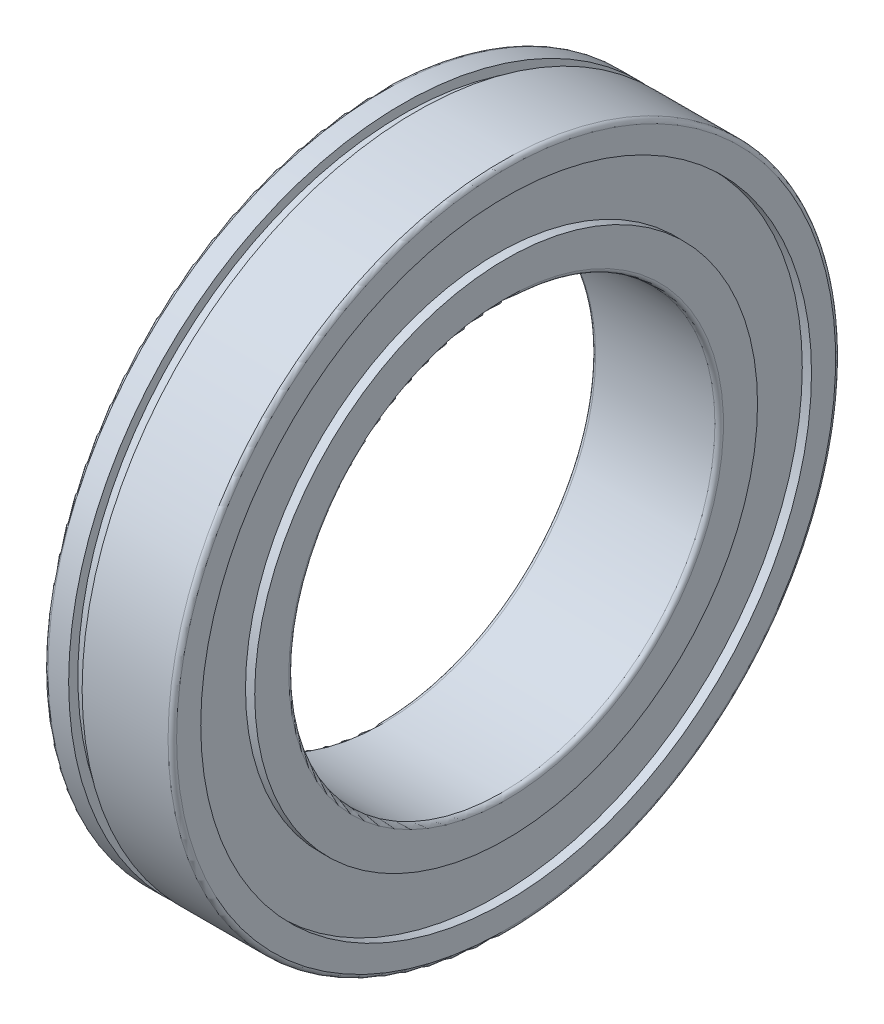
ISO-10303-21;
HEADER;
FILE_DESCRIPTION(('STEP AP214'),'2;1');
FILE_NAME('part.step','',(''),(''),'','','');
FILE_SCHEMA(('AUTOMOTIVE_DESIGN { 1 0 10303 214 1 1 1 1 }'));
ENDSEC;
DATA;
#1=APPLICATION_CONTEXT('core data for automotive mechanical design processes');
#2=APPLICATION_PROTOCOL_DEFINITION('international standard','automotive_design',2000,#1);
#3=PRODUCT_CONTEXT('',#1,'mechanical');
#4=PRODUCT('Part','Part','',(#3));
#5=PRODUCT_RELATED_PRODUCT_CATEGORY('part','',(#4));
#6=PRODUCT_DEFINITION_FORMATION('','',#4);
#7=PRODUCT_DEFINITION_CONTEXT('part definition',#1,'design');
#8=PRODUCT_DEFINITION('design','',#6,#7);
#9=PRODUCT_DEFINITION_SHAPE('','',#8);
#10=(LENGTH_UNIT() NAMED_UNIT(*) SI_UNIT(.MILLI.,.METRE.));
#11=(NAMED_UNIT(*) PLANE_ANGLE_UNIT() SI_UNIT($,.RADIAN.));
#12=(NAMED_UNIT(*) SI_UNIT($,.STERADIAN.) SOLID_ANGLE_UNIT());
#13=UNCERTAINTY_MEASURE_WITH_UNIT(LENGTH_MEASURE(1.E-05),#10,'distance_accuracy_value','');
#14=(GEOMETRIC_REPRESENTATION_CONTEXT(3) GLOBAL_UNCERTAINTY_ASSIGNED_CONTEXT((#13)) GLOBAL_UNIT_ASSIGNED_CONTEXT((#10,
#11,#12)) REPRESENTATION_CONTEXT('',''));
#15=CARTESIAN_POINT('',(0.,0.,0.));
#16=DIRECTION('',(0.,0.,1.));
#17=DIRECTION('',(1.,0.,0.));
#18=AXIS2_PLACEMENT_3D('',#15,#16,#17);
#19=CARTESIAN_POINT('',(9.,0.,0.));
#20=DIRECTION('',(-1.,0.,0.));
#21=DIRECTION('',(0.,0.,1.));
#22=AXIS2_PLACEMENT_3D('',#19,#20,#21);
#23=CYLINDRICAL_SURFACE('',#22,23.5);
#24=CARTESIAN_POINT('',(1.7,0.,0.));
#25=DIRECTION('',(-1.,0.,0.));
#26=DIRECTION('',(0.,0.,1.));
#27=AXIS2_PLACEMENT_3D('',#24,#25,#26);
#28=CIRCLE('',#27,23.5);
#29=CARTESIAN_POINT('',(1.7,0.,23.5));
#30=VERTEX_POINT('',#29);
#31=EDGE_CURVE('E34',#30,#30,#28,.T.);
#32=ORIENTED_EDGE('',*,*,#31,.T.);
#33=EDGE_LOOP('',(#32));
#34=FACE_BOUND('',#33,.T.);
#35=CARTESIAN_POINT('',(0.25,0.,0.));
#36=DIRECTION('',(-1.,0.,0.));
#37=DIRECTION('',(0.,0.,1.));
#38=AXIS2_PLACEMENT_3D('',#35,#36,#37);
#39=CIRCLE('',#38,23.5);
#40=CARTESIAN_POINT('',(0.25,0.,23.5));
#41=VERTEX_POINT('',#40);
#42=EDGE_CURVE('E52',#41,#41,#39,.T.);
#43=ORIENTED_EDGE('',*,*,#42,.F.);
#44=EDGE_LOOP('',(#43));
#45=FACE_BOUND('',#44,.T.);
#46=ADVANCED_FACE('F30',(#34,#45),#23,.T.);
#47=CARTESIAN_POINT('',(0.24999999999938,0.,0.));
#48=DIRECTION('',(-1.,0.,0.));
#49=DIRECTION('',(0.,0.,1.));
#50=AXIS2_PLACEMENT_3D('',#47,#48,#49);
#51=TOROIDAL_SURFACE('',#50,23.2500000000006,0.24999999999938);
#52=CARTESIAN_POINT('',(0.,0.,0.));
#53=DIRECTION('',(-1.,0.,0.));
#54=DIRECTION('',(0.,0.,1.));
#55=AXIS2_PLACEMENT_3D('',#52,#53,#54);
#56=CIRCLE('',#55,23.25);
#57=CARTESIAN_POINT('',(0.,0.,23.25));
#58=VERTEX_POINT('',#57);
#59=EDGE_CURVE('E10',#58,#58,#56,.T.);
#60=ORIENTED_EDGE('',*,*,#59,.F.);
#61=EDGE_LOOP('',(#60));
#62=FACE_BOUND('',#61,.T.);
#63=ORIENTED_EDGE('',*,*,#42,.T.);
#64=EDGE_LOOP('',(#63));
#65=FACE_BOUND('',#64,.T.);
#66=ADVANCED_FACE('F32',(#62,#65),#51,.T.);
#67=CARTESIAN_POINT('',(0.,23.25,0.));
#68=DIRECTION('',(1.,0.,0.));
#69=DIRECTION('',(0.,0.,-1.));
#70=AXIS2_PLACEMENT_3D('',#67,#68,#69);
#71=PLANE('',#70);
#72=CARTESIAN_POINT('',(0.,0.,0.));
#73=DIRECTION('',(-1.,0.,0.));
#74=DIRECTION('',(0.,0.,1.));
#75=AXIS2_PLACEMENT_3D('',#72,#73,#74);
#76=CIRCLE('',#75,21.5);
#77=CARTESIAN_POINT('',(0.,0.,21.5));
#78=VERTEX_POINT('',#77);
#79=EDGE_CURVE('E38',#78,#78,#76,.T.);
#80=ORIENTED_EDGE('',*,*,#79,.F.);
#81=EDGE_LOOP('',(#80));
#82=FACE_BOUND('',#81,.T.);
#83=ORIENTED_EDGE('',*,*,#59,.T.);
#84=EDGE_LOOP('',(#83));
#85=FACE_BOUND('',#84,.T.);
#86=ADVANCED_FACE('F106',(#82,#85),#71,.F.);
#87=CARTESIAN_POINT('',(9.,0.,0.));
#88=DIRECTION('',(-1.,0.,0.));
#89=DIRECTION('',(0.,0.,1.));
#90=AXIS2_PLACEMENT_3D('',#87,#88,#89);
#91=CYLINDRICAL_SURFACE('',#90,21.5);
#92=CARTESIAN_POINT('',(0.65,0.,0.));
#93=DIRECTION('',(-1.,0.,0.));
#94=DIRECTION('',(0.,0.,1.));
#95=AXIS2_PLACEMENT_3D('',#92,#93,#94);
#96=CIRCLE('',#95,21.5);
#97=CARTESIAN_POINT('',(0.65,0.,21.5));
#98=VERTEX_POINT('',#97);
#99=EDGE_CURVE('E43',#98,#98,#96,.T.);
#100=ORIENTED_EDGE('',*,*,#99,.F.);
#101=EDGE_LOOP('',(#100));
#102=FACE_BOUND('',#101,.T.);
#103=ORIENTED_EDGE('',*,*,#79,.T.);
#104=EDGE_LOOP('',(#103));
#105=FACE_BOUND('',#104,.T.);
#106=ADVANCED_FACE('F103',(#102,#105),#91,.F.);
#107=CARTESIAN_POINT('',(0.65,21.5,0.));
#108=DIRECTION('',(1.,0.,0.));
#109=DIRECTION('',(0.,0.,-1.));
#110=AXIS2_PLACEMENT_3D('',#107,#108,#109);
#111=PLANE('',#110);
#112=CARTESIAN_POINT('',(0.65,0.,0.));
#113=DIRECTION('',(-1.,0.,0.));
#114=DIRECTION('',(0.,0.,1.));
#115=AXIS2_PLACEMENT_3D('',#112,#113,#114);
#116=CIRCLE('',#115,17.7);
#117=CARTESIAN_POINT('',(0.65,0.,17.7));
#118=VERTEX_POINT('',#117);
#119=EDGE_CURVE('E96',#118,#118,#116,.T.);
#120=ORIENTED_EDGE('',*,*,#119,.F.);
#121=EDGE_LOOP('',(#120));
#122=FACE_BOUND('',#121,.T.);
#123=ORIENTED_EDGE('',*,*,#99,.T.);
#124=EDGE_LOOP('',(#123));
#125=FACE_BOUND('',#124,.T.);
#126=ADVANCED_FACE('F101',(#122,#125),#111,.F.);
#127=CARTESIAN_POINT('',(9.,0.,0.));
#128=DIRECTION('',(-1.,0.,0.));
#129=DIRECTION('',(0.,0.,1.));
#130=AXIS2_PLACEMENT_3D('',#127,#128,#129);
#131=CYLINDRICAL_SURFACE('',#130,17.7);
#132=CARTESIAN_POINT('',(0.,0.,0.));
#133=DIRECTION('',(-1.,0.,0.));
#134=DIRECTION('',(0.,0.,1.));
#135=AXIS2_PLACEMENT_3D('',#132,#133,#134);
#136=CIRCLE('',#135,17.7);
#137=CARTESIAN_POINT('',(0.,0.,17.7));
#138=VERTEX_POINT('',#137);
#139=EDGE_CURVE('E93',#138,#138,#136,.T.);
#140=ORIENTED_EDGE('',*,*,#139,.F.);
#141=EDGE_LOOP('',(#140));
#142=FACE_BOUND('',#141,.T.);
#143=ORIENTED_EDGE('',*,*,#119,.T.);
#144=EDGE_LOOP('',(#143));
#145=FACE_BOUND('',#144,.T.);
#146=ADVANCED_FACE('F190',(#142,#145),#131,.T.);
#147=CARTESIAN_POINT('',(0.,17.7,0.));
#148=DIRECTION('',(1.,0.,0.));
#149=DIRECTION('',(0.,0.,-1.));
#150=AXIS2_PLACEMENT_3D('',#147,#148,#149);
#151=PLANE('',#150);
#152=CARTESIAN_POINT('',(0.,0.,0.));
#153=DIRECTION('',(-1.,0.,0.));
#154=DIRECTION('',(0.,0.,1.));
#155=AXIS2_PLACEMENT_3D('',#152,#153,#154);
#156=CIRCLE('',#155,15.3);
#157=CARTESIAN_POINT('',(0.,0.,15.3));
#158=VERTEX_POINT('',#157);
#159=EDGE_CURVE('E90',#158,#158,#156,.T.);
#160=ORIENTED_EDGE('',*,*,#159,.F.);
#161=EDGE_LOOP('',(#160));
#162=FACE_BOUND('',#161,.T.);
#163=ORIENTED_EDGE('',*,*,#139,.T.);
#164=EDGE_LOOP('',(#163));
#165=FACE_BOUND('',#164,.T.);
#166=ADVANCED_FACE('F184',(#162,#165),#151,.F.);
#167=CARTESIAN_POINT('',(0.299999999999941,0.,0.));
#168=DIRECTION('',(-1.,0.,0.));
#169=DIRECTION('',(0.,0.,1.));
#170=AXIS2_PLACEMENT_3D('',#167,#168,#169);
#171=TOROIDAL_SURFACE('',#170,15.2999999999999,0.299999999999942);
#172=CARTESIAN_POINT('',(0.3,0.,0.));
#173=DIRECTION('',(-1.,0.,0.));
#174=DIRECTION('',(0.,0.,1.));
#175=AXIS2_PLACEMENT_3D('',#172,#173,#174);
#176=CIRCLE('',#175,15.);
#177=CARTESIAN_POINT('',(0.3,0.,15.));
#178=VERTEX_POINT('',#177);
#179=EDGE_CURVE('E87',#178,#178,#176,.T.);
#180=ORIENTED_EDGE('',*,*,#179,.F.);
#181=EDGE_LOOP('',(#180));
#182=FACE_BOUND('',#181,.T.);
#183=ORIENTED_EDGE('',*,*,#159,.T.);
#184=EDGE_LOOP('',(#183));
#185=FACE_BOUND('',#184,.T.);
#186=ADVANCED_FACE('F178',(#182,#185),#171,.T.);
#187=CARTESIAN_POINT('',(9.,0.,0.));
#188=DIRECTION('',(-1.,0.,0.));
#189=DIRECTION('',(0.,0.,1.));
#190=AXIS2_PLACEMENT_3D('',#187,#188,#189);
#191=CYLINDRICAL_SURFACE('',#190,15.);
#192=CARTESIAN_POINT('',(8.7,0.,0.));
#193=DIRECTION('',(-1.,0.,0.));
#194=DIRECTION('',(0.,0.,1.));
#195=AXIS2_PLACEMENT_3D('',#192,#193,#194);
#196=CIRCLE('',#195,15.);
#197=CARTESIAN_POINT('',(8.7,0.,15.));
#198=VERTEX_POINT('',#197);
#199=EDGE_CURVE('E84',#198,#198,#196,.T.);
#200=ORIENTED_EDGE('',*,*,#199,.F.);
#201=EDGE_LOOP('',(#200));
#202=FACE_BOUND('',#201,.T.);
#203=ORIENTED_EDGE('',*,*,#179,.T.);
#204=EDGE_LOOP('',(#203));
#205=FACE_BOUND('',#204,.T.);
#206=ADVANCED_FACE('F172',(#202,#205),#191,.F.);
#207=CARTESIAN_POINT('',(8.70000000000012,0.,0.));
#208=DIRECTION('',(-1.,0.,0.));
#209=DIRECTION('',(0.,0.,1.));
#210=AXIS2_PLACEMENT_3D('',#207,#208,#209);
#211=TOROIDAL_SURFACE('',#210,15.2999999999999,0.299999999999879);
#212=CARTESIAN_POINT('',(9.,0.,0.));
#213=DIRECTION('',(-1.,0.,0.));
#214=DIRECTION('',(0.,0.,1.));
#215=AXIS2_PLACEMENT_3D('',#212,#213,#214);
#216=CIRCLE('',#215,15.3);
#217=CARTESIAN_POINT('',(9.,0.,15.3));
#218=VERTEX_POINT('',#217);
#219=EDGE_CURVE('E81',#218,#218,#216,.T.);
#220=ORIENTED_EDGE('',*,*,#219,.F.);
#221=EDGE_LOOP('',(#220));
#222=FACE_BOUND('',#221,.T.);
#223=ORIENTED_EDGE('',*,*,#199,.T.);
#224=EDGE_LOOP('',(#223));
#225=FACE_BOUND('',#224,.T.);
#226=ADVANCED_FACE('F166',(#222,#225),#211,.T.);
#227=CARTESIAN_POINT('',(9.,15.3,0.));
#228=DIRECTION('',(-1.,0.,0.));
#229=DIRECTION('',(0.,0.,1.));
#230=AXIS2_PLACEMENT_3D('',#227,#228,#229);
#231=PLANE('',#230);
#232=CARTESIAN_POINT('',(9.,0.,0.));
#233=DIRECTION('',(-1.,0.,0.));
#234=DIRECTION('',(0.,0.,1.));
#235=AXIS2_PLACEMENT_3D('',#232,#233,#234);
#236=CIRCLE('',#235,17.7);
#237=CARTESIAN_POINT('',(9.,0.,17.7));
#238=VERTEX_POINT('',#237);
#239=EDGE_CURVE('E78',#238,#238,#236,.T.);
#240=ORIENTED_EDGE('',*,*,#239,.F.);
#241=EDGE_LOOP('',(#240));
#242=FACE_BOUND('',#241,.T.);
#243=ORIENTED_EDGE('',*,*,#219,.T.);
#244=EDGE_LOOP('',(#243));
#245=FACE_BOUND('',#244,.T.);
#246=ADVANCED_FACE('F160',(#242,#245),#231,.F.);
#247=CARTESIAN_POINT('',(9.,0.,0.));
#248=DIRECTION('',(-1.,0.,0.));
#249=DIRECTION('',(0.,0.,1.));
#250=AXIS2_PLACEMENT_3D('',#247,#248,#249);
#251=CYLINDRICAL_SURFACE('',#250,17.7);
#252=CARTESIAN_POINT('',(8.35,0.,0.));
#253=DIRECTION('',(-1.,0.,0.));
#254=DIRECTION('',(0.,0.,1.));
#255=AXIS2_PLACEMENT_3D('',#252,#253,#254);
#256=CIRCLE('',#255,17.7);
#257=CARTESIAN_POINT('',(8.35,0.,17.7));
#258=VERTEX_POINT('',#257);
#259=EDGE_CURVE('E75',#258,#258,#256,.T.);
#260=ORIENTED_EDGE('',*,*,#259,.F.);
#261=EDGE_LOOP('',(#260));
#262=FACE_BOUND('',#261,.T.);
#263=ORIENTED_EDGE('',*,*,#239,.T.);
#264=EDGE_LOOP('',(#263));
#265=FACE_BOUND('',#264,.T.);
#266=ADVANCED_FACE('F154',(#262,#265),#251,.T.);
#267=CARTESIAN_POINT('',(8.35,17.7,0.));
#268=DIRECTION('',(-1.,0.,0.));
#269=DIRECTION('',(0.,0.,1.));
#270=AXIS2_PLACEMENT_3D('',#267,#268,#269);
#271=PLANE('',#270);
#272=CARTESIAN_POINT('',(8.35,0.,0.));
#273=DIRECTION('',(-1.,0.,0.));
#274=DIRECTION('',(0.,0.,1.));
#275=AXIS2_PLACEMENT_3D('',#272,#273,#274);
#276=CIRCLE('',#275,21.5);
#277=CARTESIAN_POINT('',(8.35,0.,21.5));
#278=VERTEX_POINT('',#277);
#279=EDGE_CURVE('E72',#278,#278,#276,.T.);
#280=ORIENTED_EDGE('',*,*,#279,.F.);
#281=EDGE_LOOP('',(#280));
#282=FACE_BOUND('',#281,.T.);
#283=ORIENTED_EDGE('',*,*,#259,.T.);
#284=EDGE_LOOP('',(#283));
#285=FACE_BOUND('',#284,.T.);
#286=ADVANCED_FACE('F148',(#282,#285),#271,.F.);
#287=CARTESIAN_POINT('',(9.,0.,0.));
#288=DIRECTION('',(-1.,0.,0.));
#289=DIRECTION('',(0.,0.,1.));
#290=AXIS2_PLACEMENT_3D('',#287,#288,#289);
#291=CYLINDRICAL_SURFACE('',#290,21.5);
#292=CARTESIAN_POINT('',(9.,0.,0.));
#293=DIRECTION('',(-1.,0.,0.));
#294=DIRECTION('',(0.,0.,1.));
#295=AXIS2_PLACEMENT_3D('',#292,#293,#294);
#296=CIRCLE('',#295,21.5);
#297=CARTESIAN_POINT('',(9.,0.,21.5));
#298=VERTEX_POINT('',#297);
#299=EDGE_CURVE('E69',#298,#298,#296,.T.);
#300=ORIENTED_EDGE('',*,*,#299,.F.);
#301=EDGE_LOOP('',(#300));
#302=FACE_BOUND('',#301,.T.);
#303=ORIENTED_EDGE('',*,*,#279,.T.);
#304=EDGE_LOOP('',(#303));
#305=FACE_BOUND('',#304,.T.);
#306=ADVANCED_FACE('F142',(#302,#305),#291,.F.);
#307=CARTESIAN_POINT('',(9.,21.5,0.));
#308=DIRECTION('',(-1.,0.,0.));
#309=DIRECTION('',(0.,0.,1.));
#310=AXIS2_PLACEMENT_3D('',#307,#308,#309);
#311=PLANE('',#310);
#312=CARTESIAN_POINT('',(9.,0.,0.));
#313=DIRECTION('',(-1.,0.,0.));
#314=DIRECTION('',(0.,0.,1.));
#315=AXIS2_PLACEMENT_3D('',#312,#313,#314);
#316=CIRCLE('',#315,23.2);
#317=CARTESIAN_POINT('',(9.,0.,23.2));
#318=VERTEX_POINT('',#317);
#319=EDGE_CURVE('E66',#318,#318,#316,.T.);
#320=ORIENTED_EDGE('',*,*,#319,.F.);
#321=EDGE_LOOP('',(#320));
#322=FACE_BOUND('',#321,.T.);
#323=ORIENTED_EDGE('',*,*,#299,.T.);
#324=EDGE_LOOP('',(#323));
#325=FACE_BOUND('',#324,.T.);
#326=ADVANCED_FACE('F133',(#322,#325),#311,.F.);
#327=CARTESIAN_POINT('',(8.70000000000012,0.,0.));
#328=DIRECTION('',(-1.,0.,0.));
#329=DIRECTION('',(0.,0.,1.));
#330=AXIS2_PLACEMENT_3D('',#327,#328,#329);
#331=TOROIDAL_SURFACE('',#330,23.2000000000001,0.299999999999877);
#332=CARTESIAN_POINT('',(8.7,0.,0.));
#333=DIRECTION('',(-1.,0.,0.));
#334=DIRECTION('',(0.,0.,1.));
#335=AXIS2_PLACEMENT_3D('',#332,#333,#334);
#336=CIRCLE('',#335,23.5);
#337=CARTESIAN_POINT('',(8.7,0.,23.5));
#338=VERTEX_POINT('',#337);
#339=EDGE_CURVE('E63',#338,#338,#336,.T.);
#340=ORIENTED_EDGE('',*,*,#339,.F.);
#341=EDGE_LOOP('',(#340));
#342=FACE_BOUND('',#341,.T.);
#343=ORIENTED_EDGE('',*,*,#319,.T.);
#344=EDGE_LOOP('',(#343));
#345=FACE_BOUND('',#344,.T.);
#346=ADVANCED_FACE('F126',(#342,#345),#331,.T.);
#347=CARTESIAN_POINT('',(2.65,0.,0.));
#348=DIRECTION('',(1.,0.,0.));
#349=DIRECTION('',(0.,0.,-1.));
#350=AXIS2_PLACEMENT_3D('',#347,#348,#349);
#351=CIRCLE('',#350,23.5);
#352=CARTESIAN_POINT('',(2.65,0.,-23.5));
#353=VERTEX_POINT('',#352);
#354=EDGE_CURVE('E46',#353,#353,#351,.T.);
#355=ORIENTED_EDGE('',*,*,#354,.T.);
#356=EDGE_LOOP('',(#355));
#357=FACE_BOUND('',#356,.T.);
#358=ORIENTED_EDGE('',*,*,#339,.T.);
#359=EDGE_LOOP('',(#358));
#360=FACE_BOUND('',#359,.T.);
#361=ADVANCED_FACE('F118',(#357,#360),#23,.T.);
#362=CARTESIAN_POINT('',(1.7,27.85,0.));
#363=DIRECTION('',(-1.,0.,0.));
#364=DIRECTION('',(0.,0.,1.));
#365=AXIS2_PLACEMENT_3D('',#362,#363,#364);
#366=PLANE('',#365);
#367=CARTESIAN_POINT('',(1.7,0.,0.));
#368=DIRECTION('',(1.,0.,0.));
#369=DIRECTION('',(0.,0.,-1.));
#370=AXIS2_PLACEMENT_3D('',#367,#368,#369);
#371=CIRCLE('',#370,22.85);
#372=CARTESIAN_POINT('',(1.7,0.,-22.85));
#373=VERTEX_POINT('',#372);
#374=EDGE_CURVE('E48',#373,#373,#371,.T.);
#375=ORIENTED_EDGE('',*,*,#374,.F.);
#376=EDGE_LOOP('',(#375));
#377=FACE_BOUND('',#376,.T.);
#378=ORIENTED_EDGE('',*,*,#31,.F.);
#379=EDGE_LOOP('',(#378));
#380=FACE_BOUND('',#379,.T.);
#381=ADVANCED_FACE('F125',(#377,#380),#366,.F.);
#382=CARTESIAN_POINT('',(2.65,22.85,0.));
#383=DIRECTION('',(1.,0.,0.));
#384=DIRECTION('',(0.,0.,-1.));
#385=AXIS2_PLACEMENT_3D('',#382,#383,#384);
#386=PLANE('',#385);
#387=CARTESIAN_POINT('',(2.65,0.,0.));
#388=DIRECTION('',(1.,0.,0.));
#389=DIRECTION('',(0.,0.,-1.));
#390=AXIS2_PLACEMENT_3D('',#387,#388,#389);
#391=CIRCLE('',#390,22.85);
#392=CARTESIAN_POINT('',(2.65,0.,-22.85));
#393=VERTEX_POINT('',#392);
#394=EDGE_CURVE('E54',#393,#393,#391,.T.);
#395=ORIENTED_EDGE('',*,*,#394,.T.);
#396=EDGE_LOOP('',(#395));
#397=FACE_BOUND('',#396,.T.);
#398=ORIENTED_EDGE('',*,*,#354,.F.);
#399=EDGE_LOOP('',(#398));
#400=FACE_BOUND('',#399,.T.);
#401=ADVANCED_FACE('F131',(#397,#400),#386,.F.);
#402=CARTESIAN_POINT('',(2.65,0.,0.));
#403=DIRECTION('',(1.,0.,0.));
#404=DIRECTION('',(0.,0.,-1.));
#405=AXIS2_PLACEMENT_3D('',#402,#403,#404);
#406=CYLINDRICAL_SURFACE('',#405,22.85);
#407=ORIENTED_EDGE('',*,*,#394,.F.);
#408=EDGE_LOOP('',(#407));
#409=FACE_BOUND('',#408,.T.);
#410=ORIENTED_EDGE('',*,*,#374,.T.);
#411=EDGE_LOOP('',(#410));
#412=FACE_BOUND('',#411,.T.);
#413=ADVANCED_FACE('F272',(#409,#412),#406,.T.);
#414=CLOSED_SHELL('',(#46,#66,#86,#106,#126,#146,#166,#186,#206,#226,#246,#266,#286,#306,#326,
#346,#361,#381,#401,#413));
#415=MANIFOLD_SOLID_BREP('B2',#414);
#416=ADVANCED_BREP_SHAPE_REPRESENTATION('',(#18,#415),#14);
#417=SHAPE_DEFINITION_REPRESENTATION(#9,#416);
ENDSEC;
END-ISO-10303-21;
